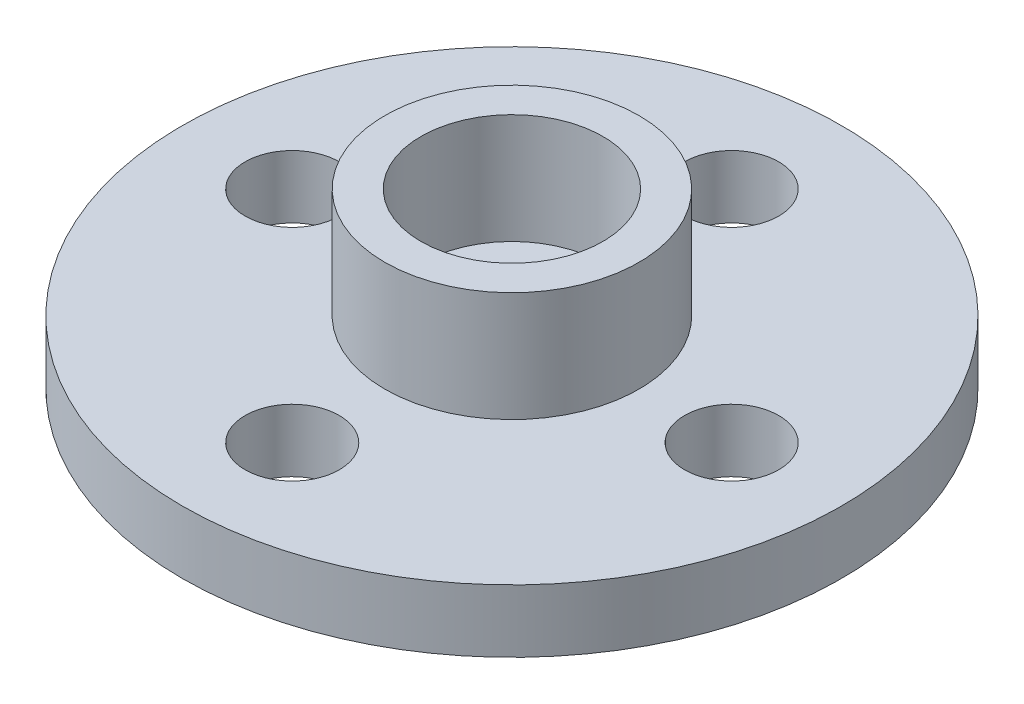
from build123d import *

# Parameters (mm, degrees)
SKETCH_1_R          = 10.5
SKETCH_1_R_2        = 1.5
EXTRUDE_1_DEPTH     = 2
SKETCH_2_R          = 4.05
EXTRUDE_2_DEPTH     = 3.5
SKETCH_3_R          = 2.9
CUT_EXTRUDE_1_DEPTH = 3.5
SKETCH_4_R          = 1.5
CUT_EXTRUDE_2_DEPTH = 3.5


with BuildPart() as part:
    # Sketch 1 → Extrude 1 (new body)
    with BuildSketch(Plane(origin=(0, 0, 0), x_dir=(1, 0, 0), z_dir=(0, 1, 0))):
        with Locations(Location((0, 0, 0), (0, 0, 270))):
            Circle(SKETCH_1_R)
        with Locations(Location((7, 0, 0), (0, 0, 270))):
            Circle(SKETCH_1_R_2, mode=Mode.SUBTRACT)
        with Locations(Location((0, -7, 0), (0, 0, 270))):
            Circle(SKETCH_1_R_2, mode=Mode.SUBTRACT)
        with Locations(Location((-7, 0, 0), (0, 0, 270))):
            Circle(SKETCH_1_R_2, mode=Mode.SUBTRACT)
        with Locations(Location((0, 7, 0), (0, 0, 270))):
            Circle(SKETCH_1_R_2, mode=Mode.SUBTRACT)
    extrude(amount=EXTRUDE_1_DEPTH)

    # Sketch 2 → Extrude 2 (add)
    with BuildSketch(Plane(origin=(0, 2, 0), x_dir=(1, 0, 0), z_dir=(0, 1, 0))):
        with Locations(Location((0, 0, 0), (0, 0, 270))):
            Circle(SKETCH_2_R)
    extrude(amount=EXTRUDE_2_DEPTH)

    # Sketch 3 → Cut-Extrude 1 (cut)
    with BuildSketch(Plane(origin=(0, 5.5, 0), x_dir=(1, 0, 0), z_dir=(0, 1, 0))):
        with Locations(Location((0, 0, 0), (0, 0, 270))):
            Circle(SKETCH_3_R)
    extrude(amount=-CUT_EXTRUDE_1_DEPTH, mode=Mode.SUBTRACT)

    # Sketch 4 → Cut-Extrude 2 (cut)
    with BuildSketch(Plane(origin=(0, 2, 0), x_dir=(1, 0, 0), z_dir=(0, 1, 0))):
        with Locations(Location((0, 0, 0), (0, 0, 270))):
            Circle(SKETCH_4_R)
    extrude(amount=-CUT_EXTRUDE_2_DEPTH, mode=Mode.SUBTRACT)


solid = part.part
